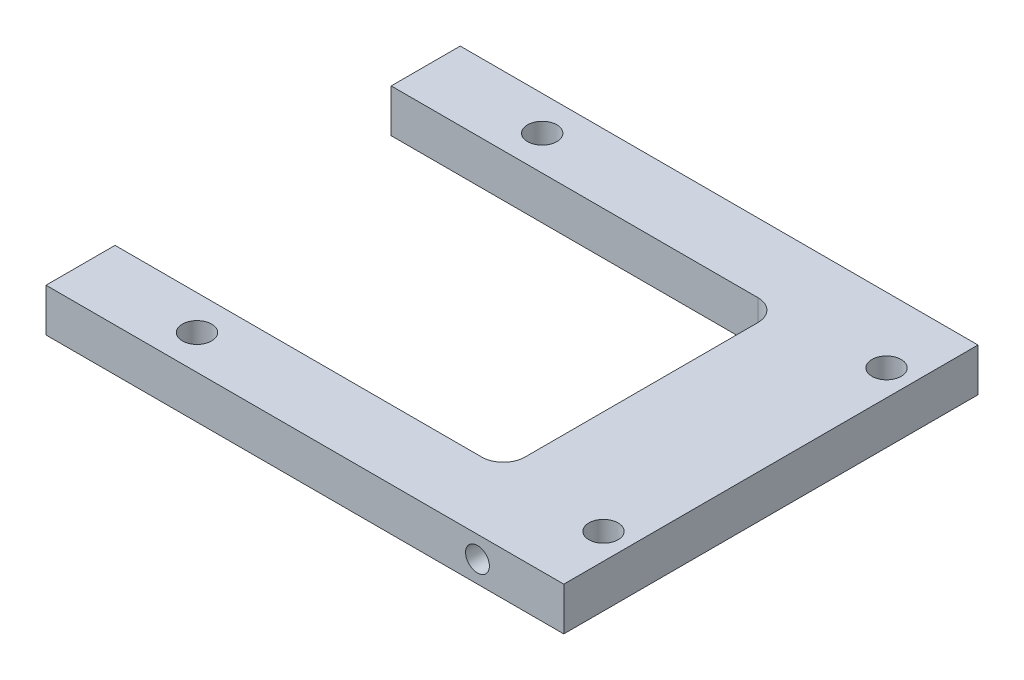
from build123d import *

# Parameters (mm, degrees)
SKETCH1_W               = 76.2
SKETCH1_H               = 60.96
EXTRUDE1_DEPTH          = 6.35
SKETCH2_R               = 2.15265
CUT_EXTRUDE1_DEPTH      = 55.487467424
SKETCH3_R               = 1.7526
CUT_EXTRUDE2_DEPTH      = 12.7
CUT_EXTRUDE5_DEPTH      = 55.487467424
CUT_EXTRUDE5_DEPTH_BACK = 55.487467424
FILLET1_R               = 3.175


with BuildPart() as part:
    # Sketch1 → Extrude1 (new body)
    with BuildSketch(Plane(origin=(0, 0, 0), x_dir=(1, 0, 0), z_dir=(0, 1, 0))):
        with Locations((-5.630259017, 1.398300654)):
            Rectangle(SKETCH1_W, SKETCH1_H)
    extrude(amount=EXTRUDE1_DEPTH)

    # Sketch2 → Cut-Extrude1 (cut, through all)
    with BuildSketch(Plane(origin=(0, 6.35, 0), x_dir=(1, 0, 0), z_dir=(0, 1, 0))):
        with Locations(Location((-26.585259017, -24.001699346, 0), (0, 0, 270))):
            Circle(SKETCH2_R)
        with Locations(Location((-26.585259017, 26.798300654, 0), (0, 0, 90))):
            Circle(SKETCH2_R)
        with Locations(Location((28.659740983, -19.429699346, 0), (0, 0, 270))):
            Circle(SKETCH2_R)
        with Locations(Location((28.659740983, 22.226300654, 0), (0, 0, 90))):
            Circle(SKETCH2_R)
    extrude(amount=-CUT_EXTRUDE1_DEPTH, mode=Mode.SUBTRACT)

    # Sketch3 → Cut-Extrude2 (cut)
    with BuildSketch(Plane.XY.offset(29.081699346)):
        with Locations((19.769740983, 3.175)):
            Circle(SKETCH3_R)
    extrude(amount=-CUT_EXTRUDE2_DEPTH, mode=Mode.SUBTRACT)

    # Sketch4 → Cut-Extrude5 (cut, two sides: drawn at the far end of the back side and taken through both)
    with BuildSketch(Plane(origin=(0, 6.35, 0), x_dir=(1, 0, 0), z_dir=(0, 1, 0)).offset(-CUT_EXTRUDE5_DEPTH_BACK)):
        Polygon((-236.892263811, 21.718300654), (-43.730259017, 21.718300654), (13.419740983, 21.718300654), (13.419740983, -18.921699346), (-43.730259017, -18.921699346), (-236.892263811, -18.921699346), (-623.216273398, -18.921699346), (-623.216273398, 21.718300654), align=None)
    extrude(amount=CUT_EXTRUDE5_DEPTH + CUT_EXTRUDE5_DEPTH_BACK, mode=Mode.SUBTRACT)

    # Fillet1
    fillet1_edges = [part.edges().sort_by_distance(p)[0] for p in [
        (13.419740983, 3.175, -21.718300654),
        (13.419740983, 3.175, 18.921699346),
    ]]
    fillet(fillet1_edges, radius=FILLET1_R)


solid = part.part
